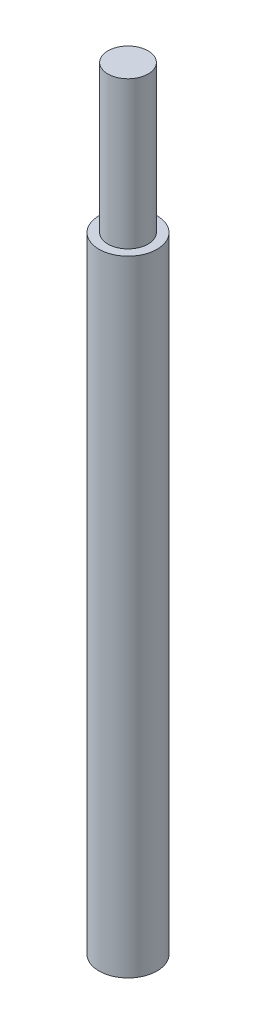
from build123d import *


with BuildPart() as part:
    # Sketch1 → Revolve1 (revolve)
    with BuildSketch(Plane.XY, mode=Mode.PRIVATE) as revolve1_sk:
        Polygon((1.651, -22.765546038), (1.651, 12.794453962), (1.143, 12.794453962), (1.143, 21.176453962), (0, 21.176453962), (0, -22.765546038), align=None)
    revolve(revolve1_sk.sketch.rotate(Axis((0, -22.765546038, 0), (0, 1, 0)), 90), axis=Axis((0, -22.765546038, 0), (0, 1, 0)))


solid = part.part
